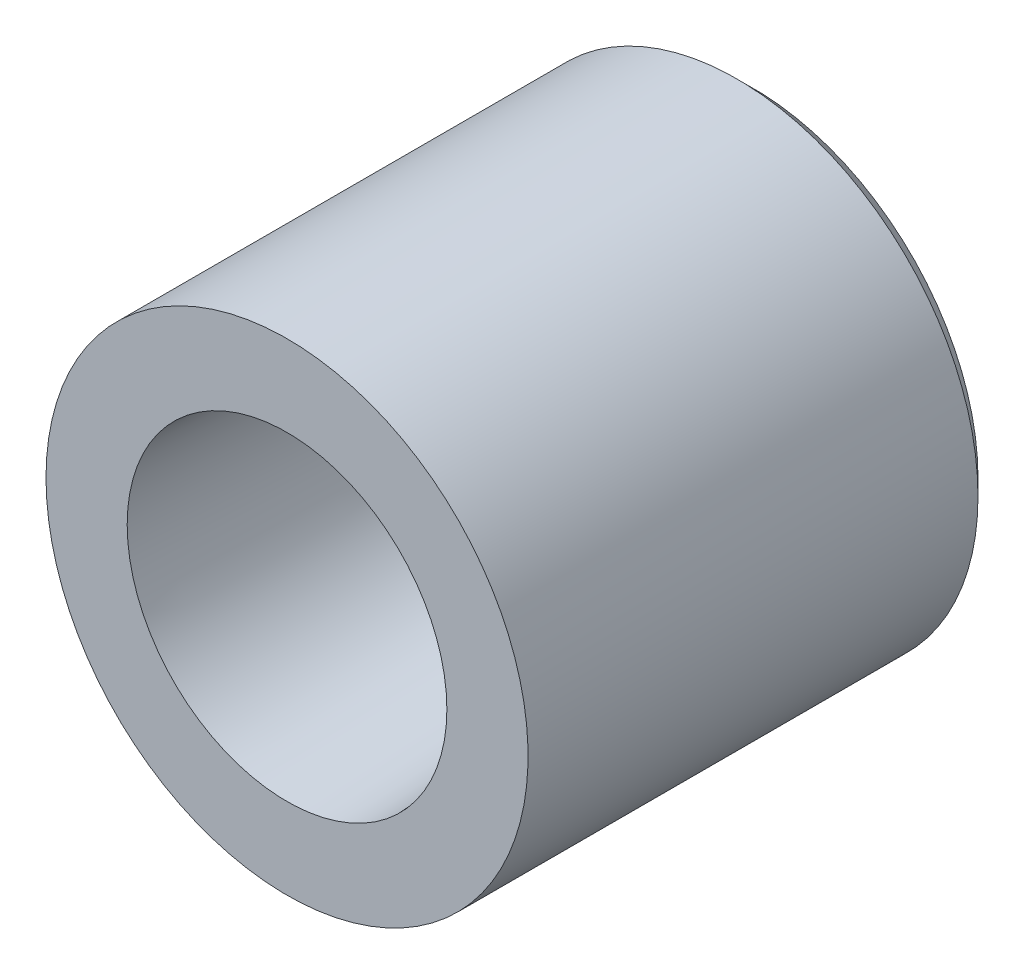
ISO-10303-21;
HEADER;
FILE_DESCRIPTION(('STEP AP214'),'2;1');
FILE_NAME('part.step','',(''),(''),'','','');
FILE_SCHEMA(('AUTOMOTIVE_DESIGN { 1 0 10303 214 1 1 1 1 }'));
ENDSEC;
DATA;
#1=APPLICATION_CONTEXT('core data for automotive mechanical design processes');
#2=APPLICATION_PROTOCOL_DEFINITION('international standard','automotive_design',2000,#1);
#3=PRODUCT_CONTEXT('',#1,'mechanical');
#4=PRODUCT('Part','Part','',(#3));
#5=PRODUCT_RELATED_PRODUCT_CATEGORY('part','',(#4));
#6=PRODUCT_DEFINITION_FORMATION('','',#4);
#7=PRODUCT_DEFINITION_CONTEXT('part definition',#1,'design');
#8=PRODUCT_DEFINITION('design','',#6,#7);
#9=PRODUCT_DEFINITION_SHAPE('','',#8);
#10=(LENGTH_UNIT() NAMED_UNIT(*) SI_UNIT(.MILLI.,.METRE.));
#11=(NAMED_UNIT(*) PLANE_ANGLE_UNIT() SI_UNIT($,.RADIAN.));
#12=(NAMED_UNIT(*) SI_UNIT($,.STERADIAN.) SOLID_ANGLE_UNIT());
#13=UNCERTAINTY_MEASURE_WITH_UNIT(LENGTH_MEASURE(1.E-05),#10,'distance_accuracy_value','');
#14=(GEOMETRIC_REPRESENTATION_CONTEXT(3) GLOBAL_UNCERTAINTY_ASSIGNED_CONTEXT((#13)) GLOBAL_UNIT_ASSIGNED_CONTEXT((#10,
#11,#12)) REPRESENTATION_CONTEXT('',''));
#15=CARTESIAN_POINT('',(0.,0.,0.));
#16=DIRECTION('',(0.,0.,1.));
#17=DIRECTION('',(1.,0.,0.));
#18=AXIS2_PLACEMENT_3D('',#15,#16,#17);
#19=CARTESIAN_POINT('',(0.,0.,-13.1834845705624));
#20=DIRECTION('',(0.,0.,1.));
#21=DIRECTION('',(1.,0.,0.));
#22=AXIS2_PLACEMENT_3D('',#19,#20,#21);
#23=CONICAL_SURFACE('',#22,13.030398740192,0.785398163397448);
#24=CARTESIAN_POINT('',(-1.25693328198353E-13,0.,-18.));
#25=DIRECTION('',(0.,0.,1.));
#26=DIRECTION('',(-1.,0.,0.));
#27=AXIS2_PLACEMENT_3D('',#24,#25,#26);
#28=CIRCLE('',#27,8.21388331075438);
#29=CARTESIAN_POINT('',(8.21388331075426,0.,-18.));
#30=VERTEX_POINT('',#29);
#31=CARTESIAN_POINT('',(-8.21388331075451,0.,-18.));
#32=VERTEX_POINT('',#31);
#33=EDGE_CURVE('E143',#30,#32,#28,.T.);
#34=ORIENTED_EDGE('',*,*,#33,.F.);
#35=CARTESIAN_POINT('',(8.21388480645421,0.,-17.9999985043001));
#36=CARTESIAN_POINT('',(9.21388629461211,0.,-16.9999970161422));
#37=B_SPLINE_CURVE_WITH_KNOTS('',1,(#35,#36),.UNSPECIFIED.,.F.,.F.,(2,2),(0.630363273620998,
0.707107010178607),.UNSPECIFIED.);
#38=CARTESIAN_POINT('',(9.21388331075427,0.,-17.));
#39=VERTEX_POINT('',#38);
#40=EDGE_CURVE('E44',#30,#39,#37,.T.);
#41=ORIENTED_EDGE('',*,*,#40,.T.);
#42=CARTESIAN_POINT('',(-1.18710365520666E-13,0.,-17.));
#43=DIRECTION('',(0.,0.,-1.));
#44=DIRECTION('',(-1.,0.,0.));
#45=AXIS2_PLACEMENT_3D('',#42,#43,#44);
#46=CIRCLE('',#45,9.21388331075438);
#47=CARTESIAN_POINT('',(-9.2138833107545,0.,-17.));
#48=VERTEX_POINT('',#47);
#49=EDGE_CURVE('E11',#48,#39,#46,.T.);
#50=ORIENTED_EDGE('',*,*,#49,.F.);
#51=CARTESIAN_POINT('',(-1.18710365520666E-13,0.,-17.));
#52=DIRECTION('',(0.,0.,-1.));
#53=DIRECTION('',(-1.,0.,0.));
#54=AXIS2_PLACEMENT_3D('',#51,#52,#53);
#55=CIRCLE('',#54,9.21388331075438);
#56=EDGE_CURVE('E51',#39,#48,#55,.T.);
#57=ORIENTED_EDGE('',*,*,#56,.F.);
#58=ORIENTED_EDGE('',*,*,#40,.F.);
#59=CARTESIAN_POINT('',(-1.25693328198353E-13,0.,-18.));
#60=DIRECTION('',(0.,0.,1.));
#61=DIRECTION('',(-1.,0.,0.));
#62=AXIS2_PLACEMENT_3D('',#59,#60,#61);
#63=CIRCLE('',#62,8.21388331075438);
#64=EDGE_CURVE('E59',#32,#30,#63,.T.);
#65=ORIENTED_EDGE('',*,*,#64,.F.);
#66=EDGE_LOOP('',(#34,#41,#50,#57,#58,#65));
#67=FACE_BOUND('',#66,.T.);
#68=ADVANCED_FACE('F36',(#67),#23,.F.);
#69=CARTESIAN_POINT('',(-1.15218884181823E-13,0.,-16.5));
#70=DIRECTION('',(0.,0.,-1.));
#71=DIRECTION('',(-1.,0.,0.));
#72=AXIS2_PLACEMENT_3D('',#69,#70,#71);
#73=CYLINDRICAL_SURFACE('',#72,9.21388331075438);
#74=CARTESIAN_POINT('',(-1.04744440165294E-13,0.,-15.));
#75=DIRECTION('',(0.,0.,-1.));
#76=DIRECTION('',(-1.,0.,0.));
#77=AXIS2_PLACEMENT_3D('',#74,#75,#76);
#78=CIRCLE('',#77,9.21388331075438);
#79=CARTESIAN_POINT('',(-9.21388331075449,0.,-15.));
#80=VERTEX_POINT('',#79);
#81=EDGE_CURVE('E152',#80,#80,#78,.T.);
#82=ORIENTED_EDGE('',*,*,#81,.F.);
#83=CARTESIAN_POINT('',(-9.21388331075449,0.,-14.9999969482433));
#84=CARTESIAN_POINT('',(-9.2138833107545,0.,-17.0000020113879));
#85=B_SPLINE_CURVE_WITH_KNOTS('',1,(#83,#84),.UNSPECIFIED.,.F.,.F.,(2,2),(0.0833320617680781,
0.91666750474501),.UNSPECIFIED.);
#86=EDGE_CURVE('E147',#80,#48,#85,.T.);
#87=ORIENTED_EDGE('',*,*,#86,.T.);
#88=ORIENTED_EDGE('',*,*,#49,.T.);
#89=ORIENTED_EDGE('',*,*,#56,.T.);
#90=ORIENTED_EDGE('',*,*,#86,.F.);
#91=EDGE_LOOP('',(#82,#87,#88,#89,#90));
#92=FACE_BOUND('',#91,.T.);
#93=ADVANCED_FACE('F191',(#92),#73,.F.);
#94=CARTESIAN_POINT('',(18.8919316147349,-17.0722358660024,-18.));
#95=DIRECTION('',(0.,0.,-1.));
#96=DIRECTION('',(-1.,0.,0.));
#97=AXIS2_PLACEMENT_3D('',#94,#95,#96);
#98=PLANE('',#97);
#99=CARTESIAN_POINT('',(-2.09488880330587E-13,0.,-17.9999999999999));
#100=DIRECTION('',(0.,0.,-1.));
#101=DIRECTION('',(-1.,0.,0.));
#102=AXIS2_PLACEMENT_3D('',#99,#100,#101);
#103=CIRCLE('',#102,4.24999999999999);
#104=CARTESIAN_POINT('',(-4.2500000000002,0.,-17.9999999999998));
#105=VERTEX_POINT('',#104);
#106=EDGE_CURVE('E103',#105,#105,#103,.T.);
#107=ORIENTED_EDGE('',*,*,#106,.T.);
#108=EDGE_LOOP('',(#107));
#109=FACE_BOUND('',#108,.T.);
#110=ORIENTED_EDGE('',*,*,#64,.T.);
#111=ORIENTED_EDGE('',*,*,#33,.T.);
#112=EDGE_LOOP('',(#110,#111));
#113=FACE_BOUND('',#112,.T.);
#114=ADVANCED_FACE('F193',(#109,#113),#98,.F.);
#115=CARTESIAN_POINT('',(0.,0.,-1.));
#116=DIRECTION('',(0.,0.,1.));
#117=DIRECTION('',(-1.,0.,0.));
#118=AXIS2_PLACEMENT_3D('',#115,#116,#117);
#119=CONICAL_SURFACE('',#118,9.94759222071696,0.0523598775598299);
#120=ORIENTED_EDGE('',*,*,#81,.T.);
#121=CARTESIAN_POINT('',(-9.21388331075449,0.,-15.));
#122=CARTESIAN_POINT('',(-9.94759222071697,0.,-0.999999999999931));
#123=B_SPLINE_CURVE_WITH_KNOTS('',1,(#121,#122),.UNSPECIFIED.,.F.,.F.,(2,2),(0.,1.),.UNSPECIFIED.);
#124=CARTESIAN_POINT('',(-9.94759222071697,0.,-0.999999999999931));
#125=VERTEX_POINT('',#124);
#126=EDGE_CURVE('E108',#80,#125,#123,.T.);
#127=ORIENTED_EDGE('',*,*,#126,.T.);
#128=CARTESIAN_POINT('',(0.,0.,-1.));
#129=DIRECTION('',(0.,0.,-1.));
#130=DIRECTION('',(1.,0.,0.));
#131=AXIS2_PLACEMENT_3D('',#128,#129,#130);
#132=CIRCLE('',#131,9.94759222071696);
#133=CARTESIAN_POINT('',(9.94759222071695,0.,-1.00000000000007));
#134=VERTEX_POINT('',#133);
#135=EDGE_CURVE('E133',#134,#125,#132,.T.);
#136=ORIENTED_EDGE('',*,*,#135,.F.);
#137=CARTESIAN_POINT('',(0.,0.,-1.));
#138=DIRECTION('',(0.,0.,-1.));
#139=DIRECTION('',(1.,0.,0.));
#140=AXIS2_PLACEMENT_3D('',#137,#138,#139);
#141=CIRCLE('',#140,9.94759222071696);
#142=EDGE_CURVE('E126',#125,#134,#141,.T.);
#143=ORIENTED_EDGE('',*,*,#142,.F.);
#144=ORIENTED_EDGE('',*,*,#126,.F.);
#145=EDGE_LOOP('',(#120,#127,#136,#143,#144));
#146=FACE_BOUND('',#145,.T.);
#147=ADVANCED_FACE('F189',(#146),#119,.F.);
#148=CARTESIAN_POINT('',(-1.5911934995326E-13,0.,-22.7867965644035));
#149=DIRECTION('',(0.,0.,1.));
#150=DIRECTION('',(1.,0.,0.));
#151=AXIS2_PLACEMENT_3D('',#148,#149,#150);
#152=CONICAL_SURFACE('',#151,21.2132034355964,0.785398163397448);
#153=CARTESIAN_POINT('',(-2.09488880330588E-13,0.,-30.));
#154=DIRECTION('',(0.,0.,1.));
#155=DIRECTION('',(-1.,0.,0.));
#156=AXIS2_PLACEMENT_3D('',#153,#154,#155);
#157=CIRCLE('',#156,14.);
#158=CARTESIAN_POINT('',(-14.0000000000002,0.,-30.));
#159=VERTEX_POINT('',#158);
#160=CARTESIAN_POINT('',(13.9999999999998,0.,-30.));
#161=VERTEX_POINT('',#160);
#162=EDGE_CURVE('E90',#159,#161,#157,.T.);
#163=ORIENTED_EDGE('',*,*,#162,.T.);
#164=CARTESIAN_POINT('',(14.0000009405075,0.,-29.9999990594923));
#165=CARTESIAN_POINT('',(15.0000023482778,0.,-28.9999976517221));
#166=B_SPLINE_CURVE_WITH_KNOTS('',1,(#164,#165),.UNSPECIFIED.,.F.,.F.,(2,2),(0.659966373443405,
0.707106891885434),.UNSPECIFIED.);
#167=CARTESIAN_POINT('',(14.9999999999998,0.,-29.));
#168=VERTEX_POINT('',#167);
#169=EDGE_CURVE('E95',#161,#168,#166,.T.);
#170=ORIENTED_EDGE('',*,*,#169,.T.);
#171=CARTESIAN_POINT('',(-2.02505917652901E-13,0.,-29.));
#172=DIRECTION('',(0.,0.,-1.));
#173=DIRECTION('',(-1.,0.,0.));
#174=AXIS2_PLACEMENT_3D('',#171,#172,#173);
#175=CIRCLE('',#174,15.);
#176=CARTESIAN_POINT('',(-15.,0.,-29.));
#177=VERTEX_POINT('',#176);
#178=EDGE_CURVE('E102',#168,#177,#175,.T.);
#179=ORIENTED_EDGE('',*,*,#178,.T.);
#180=CARTESIAN_POINT('',(-2.02505917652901E-13,0.,-29.));
#181=DIRECTION('',(0.,0.,-1.));
#182=DIRECTION('',(-1.,0.,0.));
#183=AXIS2_PLACEMENT_3D('',#180,#181,#182);
#184=CIRCLE('',#183,15.);
#185=EDGE_CURVE('E105',#177,#168,#184,.T.);
#186=ORIENTED_EDGE('',*,*,#185,.T.);
#187=ORIENTED_EDGE('',*,*,#169,.F.);
#188=CARTESIAN_POINT('',(-2.09488880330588E-13,0.,-30.));
#189=DIRECTION('',(0.,0.,1.));
#190=DIRECTION('',(-1.,0.,0.));
#191=AXIS2_PLACEMENT_3D('',#188,#189,#190);
#192=CIRCLE('',#191,14.);
#193=EDGE_CURVE('E97',#161,#159,#192,.T.);
#194=ORIENTED_EDGE('',*,*,#193,.T.);
#195=EDGE_LOOP('',(#163,#170,#179,#186,#187,#194));
#196=FACE_BOUND('',#195,.T.);
#197=ADVANCED_FACE('F92',(#196),#152,.T.);
#198=CARTESIAN_POINT('',(-1.08235921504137E-13,0.,-15.5));
#199=DIRECTION('',(0.,0.,-1.));
#200=DIRECTION('',(-1.,0.,0.));
#201=AXIS2_PLACEMENT_3D('',#198,#199,#200);
#202=CYLINDRICAL_SURFACE('',#201,15.);
#203=CARTESIAN_POINT('',(0.,0.,-1.));
#204=DIRECTION('',(0.,0.,1.));
#205=DIRECTION('',(-1.,0.,0.));
#206=AXIS2_PLACEMENT_3D('',#203,#204,#205);
#207=CIRCLE('',#206,15.);
#208=CARTESIAN_POINT('',(-15.,0.,-0.999999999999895));
#209=VERTEX_POINT('',#208);
#210=EDGE_CURVE('E99',#209,#209,#207,.T.);
#211=ORIENTED_EDGE('',*,*,#210,.F.);
#212=CARTESIAN_POINT('',(-15.,0.,-0.99999893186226));
#213=CARTESIAN_POINT('',(-15.,0.,-28.9999996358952));
#214=B_SPLINE_CURVE_WITH_KNOTS('',1,(#212,#213),.UNSPECIFIED.,.F.,.F.,(2,2),(0.0833333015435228,
0.916666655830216),.UNSPECIFIED.);
#215=EDGE_CURVE('E173',#209,#177,#214,.T.);
#216=ORIENTED_EDGE('',*,*,#215,.T.);
#217=ORIENTED_EDGE('',*,*,#178,.F.);
#218=ORIENTED_EDGE('',*,*,#185,.F.);
#219=ORIENTED_EDGE('',*,*,#215,.F.);
#220=EDGE_LOOP('',(#211,#216,#217,#218,#219));
#221=FACE_BOUND('',#220,.T.);
#222=ADVANCED_FACE('F225',(#221),#202,.T.);
#223=CARTESIAN_POINT('',(32.2,-29.0984535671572,-30.));
#224=DIRECTION('',(0.,0.,-1.));
#225=DIRECTION('',(-1.,0.,0.));
#226=AXIS2_PLACEMENT_3D('',#223,#224,#225);
#227=PLANE('',#226);
#228=CARTESIAN_POINT('',(-2.09488880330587E-13,0.,-29.9999999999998));
#229=DIRECTION('',(0.,0.,-1.));
#230=DIRECTION('',(-1.,0.,0.));
#231=AXIS2_PLACEMENT_3D('',#228,#229,#230);
#232=CIRCLE('',#231,4.24999999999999);
#233=CARTESIAN_POINT('',(-4.2500000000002,0.,-29.9999999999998));
#234=VERTEX_POINT('',#233);
#235=EDGE_CURVE('E275',#234,#234,#232,.T.);
#236=ORIENTED_EDGE('',*,*,#235,.F.);
#237=EDGE_LOOP('',(#236));
#238=FACE_BOUND('',#237,.T.);
#239=ORIENTED_EDGE('',*,*,#193,.F.);
#240=ORIENTED_EDGE('',*,*,#162,.F.);
#241=EDGE_LOOP('',(#239,#240));
#242=FACE_BOUND('',#241,.T.);
#243=ADVANCED_FACE('F101',(#238,#242),#227,.T.);
#244=CARTESIAN_POINT('',(-19.5,-31.1769145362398,-0.999999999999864));
#245=DIRECTION('',(0.,0.,1.));
#246=DIRECTION('',(1.,0.,0.));
#247=AXIS2_PLACEMENT_3D('',#244,#245,#246);
#248=PLANE('',#247);
#249=ORIENTED_EDGE('',*,*,#210,.T.);
#250=EDGE_LOOP('',(#249));
#251=FACE_BOUND('',#250,.T.);
#252=ORIENTED_EDGE('',*,*,#135,.T.);
#253=ORIENTED_EDGE('',*,*,#142,.T.);
#254=EDGE_LOOP('',(#252,#253));
#255=FACE_BOUND('',#254,.T.);
#256=ADVANCED_FACE('F240',(#251,#255),#248,.T.);
#257=CARTESIAN_POINT('',(-2.09488880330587E-13,0.,-29.9999999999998));
#258=DIRECTION('',(0.,0.,-1.));
#259=DIRECTION('',(-1.,0.,0.));
#260=AXIS2_PLACEMENT_3D('',#257,#258,#259);
#261=CYLINDRICAL_SURFACE('',#260,4.24999999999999);
#262=ORIENTED_EDGE('',*,*,#235,.T.);
#263=EDGE_LOOP('',(#262));
#264=FACE_BOUND('',#263,.T.);
#265=ORIENTED_EDGE('',*,*,#106,.F.);
#266=EDGE_LOOP('',(#265));
#267=FACE_BOUND('',#266,.T.);
#268=ADVANCED_FACE('F248',(#264,#267),#261,.F.);
#269=CLOSED_SHELL('',(#68,#93,#114,#147,#197,#222,#243,#256,#268));
#270=MANIFOLD_SOLID_BREP('B2',#269);
#271=ADVANCED_BREP_SHAPE_REPRESENTATION('',(#18,#270),#14);
#272=SHAPE_DEFINITION_REPRESENTATION(#9,#271);
ENDSEC;
END-ISO-10303-21;
